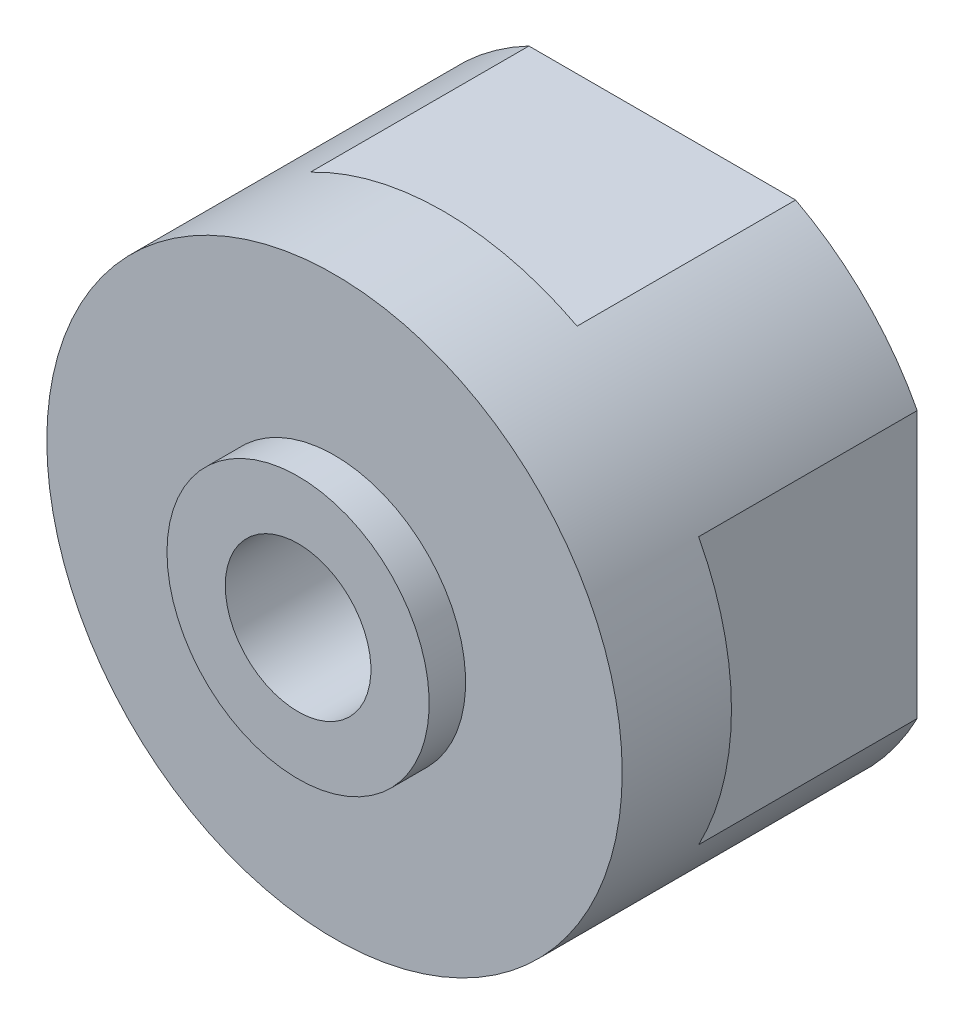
from build123d import *

# Parameters (mm, degrees)
R_P_TITION_CIRCULAIRE1_COUNT = 6
ESQUISSE8_W                  = 48.277432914
ESQUISSE8_H                  = 12.203462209
ESQUISSE8_W_2                = 15.690165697
ESQUISSE8_H_2                = 72.684357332
ESQUISSE8_W_3                = 67.320198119
ESQUISSE8_H_3                = 13.008086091
ESQUISSE8_W_4                = 23.199988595
ESQUISSE8_H_4                = 58.737543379
ENL_V_MAT_EXTRU_3_DEPTH      = 30


with BuildPart() as part:
    # Esquisse4 → R_volution1 (revolve)
    with BuildSketch(Plane(origin=(0, 0, 0), x_dir=(0, 0, -1), z_dir=(1, 0, 0)), mode=Mode.PRIVATE) as r_volution1_sk:
        Polygon((-22.773901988, 39.5), (-67.773901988, 39.5), (-67.773901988, 18), (-72.773901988, 18), (-72.773901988, 10), (-42.773901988, 10), (-42.773901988, 12), (-22.773901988, 12), align=None)
    revolve(r_volution1_sk.sketch.rotate(Axis((0, 0, 0), (0, 0, 1)), 90), axis=Axis((0, 0, 0), (0, 0, 1)))

    # Esquisse6 → Diam_tre du per_age _7.0 _7_1 (revolve, cut)
    with BuildSketch(Plane(origin=(19.8, 0, 22.773901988), x_dir=(0, 1, 0), z_dir=(1, 0, 0))):
        Polygon((0, 0), (0, 17.103012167), (3.5, 15), (3.5, 0), align=None)
    diam_tre_du_per_age_7_0_7_1 = revolve(axis=Axis((19.8, 0, 16.423901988), (0, 0, 1)), mode=Mode.SUBTRACT)

    # R_p_tition circulaire1: Diam_tre du per_age _7.0 _7_1 ×6 about axis
    r_p_tition_circulaire1_axis = Axis((0, 0, 0), (0, 0, 1))
    for i in range(1, R_P_TITION_CIRCULAIRE1_COUNT):
        add(diam_tre_du_per_age_7_0_7_1.rotate(r_p_tition_circulaire1_axis, i * 360 / R_P_TITION_CIRCULAIRE1_COUNT), mode=Mode.SUBTRACT)

    # Esquisse8 → Enl_v. mat.-Extru.3 (cut)
    with BuildSketch(Plane(origin=(0, 0, 22.773901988), x_dir=(-1, 0, 0), z_dir=(0, 0, -1))):
        with Locations((0.536415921, 41.101731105)):
            Rectangle(ESQUISSE8_W, ESQUISSE8_H)
        with Locations((42.845082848, -4.626587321)):
            Rectangle(ESQUISSE8_W_2, ESQUISSE8_H_2)
        with Locations((-4.559535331, -41.504043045)):
            Rectangle(ESQUISSE8_W_3, ESQUISSE8_H_3)
        with Locations((-46.599994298, -0.603467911)):
            Rectangle(ESQUISSE8_W_4, ESQUISSE8_H_4)
    extrude(amount=-ENL_V_MAT_EXTRU_3_DEPTH, mode=Mode.SUBTRACT)


solid = part.part
